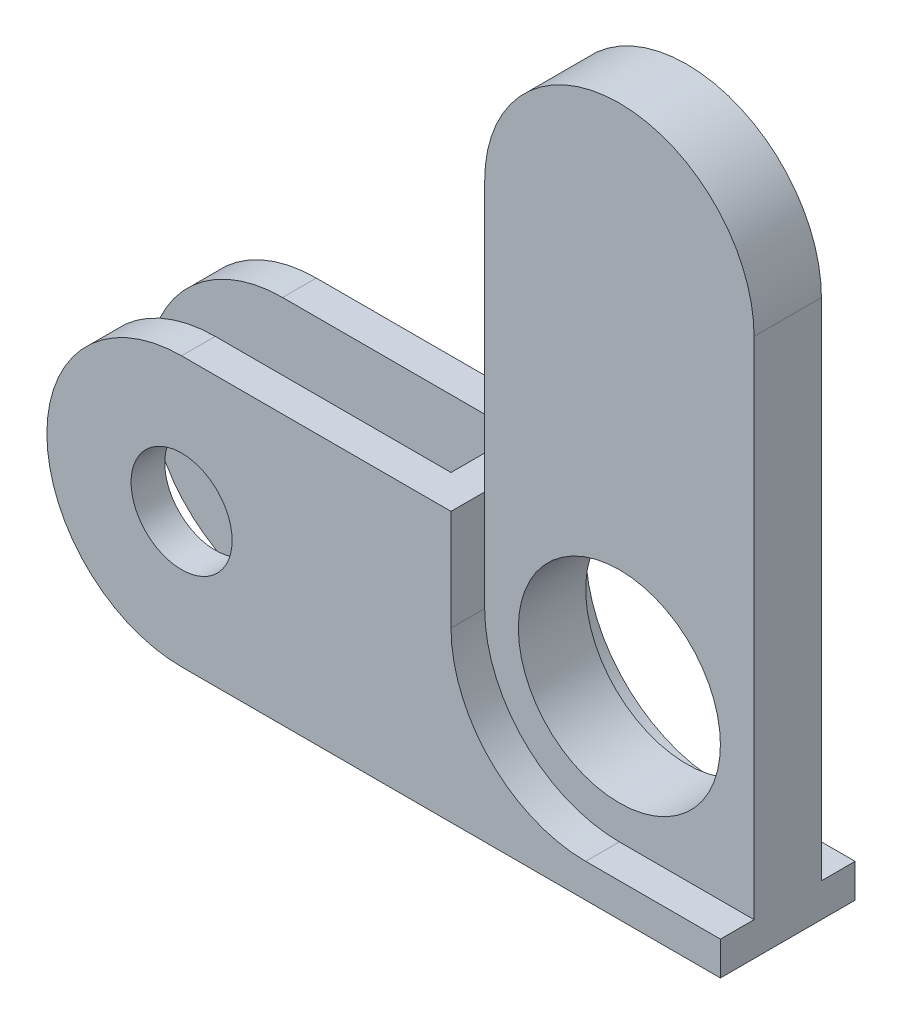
from build123d import *

# Parameters (mm, degrees)
SKETCH_1_W          = 100
SKETCH_1_H          = 100
EXTRUDE_1_DEPTH     = 10
SKETCH_3_R          = 7.5
SKETCH_3_R_2        = 15
CUT_EXTRUDE_1_DEPTH = 143.828568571
SKETCH_4_W          = 60
SKETCH_4_H          = 60
CUT_EXTRUDE_2_DEPTH = 143.828568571
SKETCH_5_W          = 40
SKETCH_5_H          = 95
CUT_EXTRUDE_3_DEPTH = 5
FILLET_1_RADIUS     = 20
FILLET_1_LENGTH     = 20
FILLET_2_RADIUS     = 20
FILLET_2_LENGTH     = 10
FILLET_3_R          = 20
SKETCH_6_W          = 55
SKETCH_6_H          = 10
CUT_EXTRUDE_4_DEPTH = 118.046999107


with BuildPart() as part:
    # Sketch 1 → Extrude 1 (new, symmetric)
    with BuildSketch(Plane.XY):
        with Locations((-50, 50)):
            Rectangle(SKETCH_1_W, SKETCH_1_H)
    extrude(amount=EXTRUDE_1_DEPTH, both=True)

    # Sketch 3 → Cut-Extrude 1 (cut, through all)
    with BuildSketch(Plane.XY.offset(10)):
        with Locations((-80, 20)):
            Circle(SKETCH_3_R)
        with Locations((-20, 25)):
            Circle(SKETCH_3_R_2)
    extrude(amount=-CUT_EXTRUDE_1_DEPTH, mode=Mode.SUBTRACT)

    # Sketch 4 → Cut-Extrude 2 (cut, through all)
    with BuildSketch(Plane.XY.offset(10)):
        with Locations((-70, 70)):
            Rectangle(SKETCH_4_W, SKETCH_4_H)
    extrude(amount=-CUT_EXTRUDE_2_DEPTH, mode=Mode.SUBTRACT)

    # Sketch 5 → Cut-Extrude 3 (cut)
    with BuildSketch(Plane.XY.offset(10)):
        with Locations((-20, 52.5)):
            Rectangle(SKETCH_5_W, SKETCH_5_H)
    cut_extrude_3 = extrude(amount=-CUT_EXTRUDE_3_DEPTH, mode=Mode.SUBTRACT)

    # Mirror 1: Cut-Extrude 3 across plane
    add(cut_extrude_3.mirror(Plane.XY), mode=Mode.SUBTRACT)

    # Fillet 1: full round fillet: the end face becomes a half cylinder, R = half its width
    fillet_1_face = Plane((-100, 20, 0), x_dir=(0, 0, -1), z_dir=(-1, 0, 0))  # on the end face: x along it, z out of the body
    fillet_1_slab = fillet_1_face.offset(-FILLET_1_RADIUS / 2) * Box(FILLET_1_LENGTH, 2 * FILLET_1_RADIUS, FILLET_1_RADIUS, mode=Mode.PRIVATE)  # the body's end, R deep
    fillet_1_round = Plane((-80, 20, 0), x_dir=(-1, 0, 0), z_dir=(0, 0, -1)) * Cylinder(FILLET_1_RADIUS, FILLET_1_LENGTH, mode=Mode.PRIVATE)  # its axis R under the face
    add(fillet_1_slab - fillet_1_round, mode=Mode.SUBTRACT)

    # Fillet 2: full round fillet: the end face becomes a half cylinder, R = half its width
    fillet_2_face = Plane((-20, 100, 0), x_dir=(0, 0, -1), z_dir=(0, 1, 0))  # on the end face: x along it, z out of the body
    fillet_2_slab = fillet_2_face.offset(-FILLET_2_RADIUS / 2) * Box(FILLET_2_LENGTH, 2 * FILLET_2_RADIUS, FILLET_2_RADIUS, mode=Mode.PRIVATE)  # the body's end, R deep
    fillet_2_round = Plane((-20, 80, 0), x_dir=(0, 1, 0), z_dir=(0, 0, -1)) * Cylinder(FILLET_2_RADIUS, FILLET_2_LENGTH, mode=Mode.PRIVATE)  # its axis R under the face
    add(fillet_2_slab - fillet_2_round, mode=Mode.SUBTRACT)

    # Fillet 3
    fillet_3_edges = [part.edges().sort_by_distance(p)[0] for p in [
        (-40, 5, 7.5),
        (-40, 5, -7.5),
    ]]
    fillet(fillet_3_edges, radius=FILLET_3_R)

    # Sketch 6 → Cut-Extrude 4 (cut, through all)
    with BuildSketch(Plane(origin=(0, 40, 0), x_dir=(1, 0, 0), z_dir=(0, 1, 0))):
        with Locations((-72.5, 0)):
            Rectangle(SKETCH_6_W, SKETCH_6_H)
    extrude(amount=-CUT_EXTRUDE_4_DEPTH, mode=Mode.SUBTRACT)


solid = part.part
